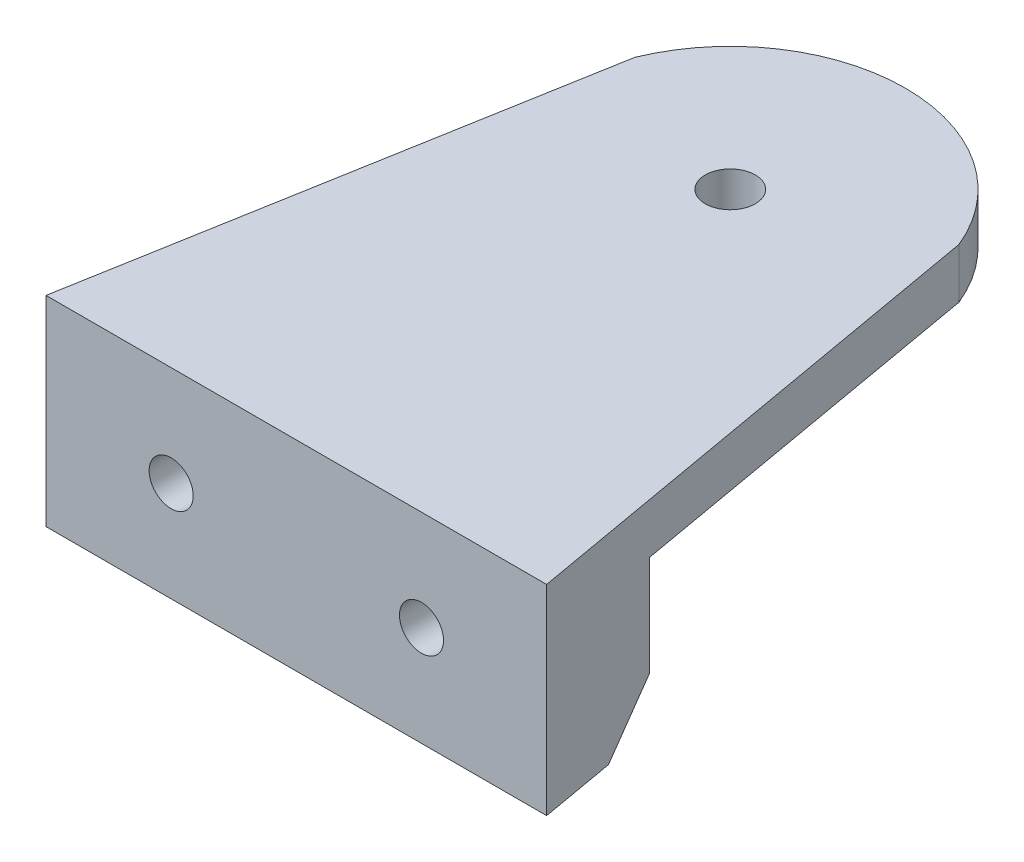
from build123d import *

# Parameters (mm, degrees)
EXTRUIR1_DEPTH                      = 40
TALADRO_ROSCADO_DE_M10X1_25_1_D     = 8.8
TALADRO_ROSCADO_DE_M10X1_25_1_DEPTH = 20
TALADRO_ROSCADO_DE_M10X1_25_1_TIP   = 2.643786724
CROQUIS5_R                          = 5
CORTAR_EXTRUIR2_DEPTH               = 40
CROQUIS6_W                          = 109.558645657
CROQUIS6_H                          = 40
CORTAR_EXTRUIR3_DEPTH               = 130.376853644
CHAFL_N1_SIZE                       = 10


with BuildPart() as part:
    # Croquis1 → Extruir1 (new body)
    with BuildSketch(Plane(origin=(0, 0, 0), x_dir=(1, 0, 0), z_dir=(0, 1, 0))):
        with BuildLine():
            Line((-50, -50), (50, -50))
            Line((50, -50), (32.367301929, 50))
            ThreePointArc((32.367301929, 50), (0, 71.682426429), (-32.367301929, 50))
            Line((-32.367301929, 50), (-50, -50))
        make_face()
    extrude(amount=EXTRUIR1_DEPTH)

    # Taladro roscado de M10x1.25-1
    with Locations(Plane(origin=(-25, 20, 50), x_dir=(1, 0, 0), z_dir=(0, 0, 1))):
        with Locations((0, 0), (50, 0)):
            Hole(TALADRO_ROSCADO_DE_M10X1_25_1_D / 2, depth=TALADRO_ROSCADO_DE_M10X1_25_1_DEPTH)
            with Locations((0, 0, -(TALADRO_ROSCADO_DE_M10X1_25_1_DEPTH + TALADRO_ROSCADO_DE_M10X1_25_1_TIP / 2))):  # 118° drill point
                Cone(0, TALADRO_ROSCADO_DE_M10X1_25_1_D / 2, TALADRO_ROSCADO_DE_M10X1_25_1_TIP, mode=Mode.SUBTRACT)

    # Croquis5 → Cortar-Extruir2 (cut)
    with BuildSketch(Plane(origin=(0, 40, 0), x_dir=(1, 0, 0), z_dir=(0, 1, 0))):
        with Locations(Location((0, 36.682426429, 0), (0, 0, 270))):
            Circle(CROQUIS5_R)
    extrude(amount=-CORTAR_EXTRUIR2_DEPTH, mode=Mode.SUBTRACT)

    # Croquis6 → Cortar-Extruir3 (cut, through all)
    with BuildSketch(Plane(origin=(50, 0, 0), x_dir=(0, 0, -1), z_dir=(1, 0, 0))):
        with Locations((29.779322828, 10)):
            Rectangle(CROQUIS6_W, CROQUIS6_H)
    extrude(amount=-CORTAR_EXTRUIR3_DEPTH, mode=Mode.SUBTRACT)

    # Chafl_n1
    chafl_n1_edges = [part.edges().sort_by_distance(p)[0] for p in [
        (0, 0, 25),
    ]]
    chamfer(chafl_n1_edges, length=CHAFL_N1_SIZE)


solid = part.part
